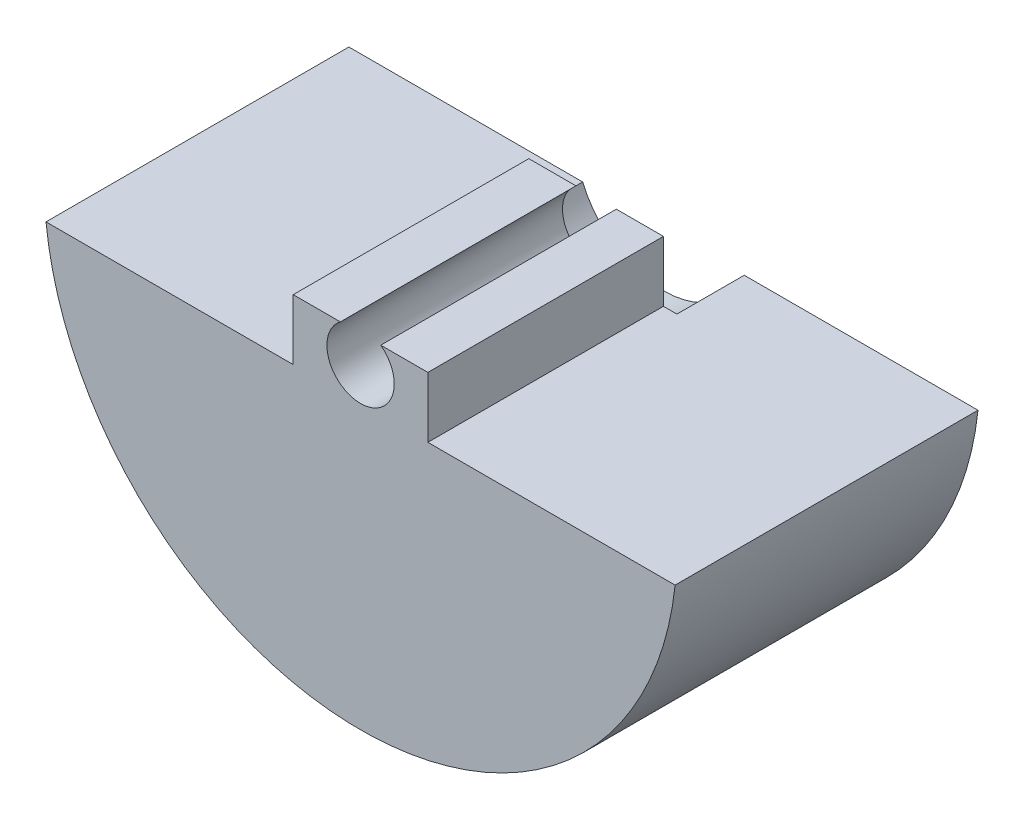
ISO-10303-21;
HEADER;
FILE_DESCRIPTION(('STEP AP214'),'2;1');
FILE_NAME('part.step','',(''),(''),'','','');
FILE_SCHEMA(('AUTOMOTIVE_DESIGN { 1 0 10303 214 1 1 1 1 }'));
ENDSEC;
DATA;
#1=APPLICATION_CONTEXT('core data for automotive mechanical design processes');
#2=APPLICATION_PROTOCOL_DEFINITION('international standard','automotive_design',2000,#1);
#3=PRODUCT_CONTEXT('',#1,'mechanical');
#4=PRODUCT('Part','Part','',(#3));
#5=PRODUCT_RELATED_PRODUCT_CATEGORY('part','',(#4));
#6=PRODUCT_DEFINITION_FORMATION('','',#4);
#7=PRODUCT_DEFINITION_CONTEXT('part definition',#1,'design');
#8=PRODUCT_DEFINITION('design','',#6,#7);
#9=PRODUCT_DEFINITION_SHAPE('','',#8);
#10=(LENGTH_UNIT() NAMED_UNIT(*) SI_UNIT(.MILLI.,.METRE.));
#11=(NAMED_UNIT(*) PLANE_ANGLE_UNIT() SI_UNIT($,.RADIAN.));
#12=(NAMED_UNIT(*) SI_UNIT($,.STERADIAN.) SOLID_ANGLE_UNIT());
#13=UNCERTAINTY_MEASURE_WITH_UNIT(LENGTH_MEASURE(1.E-05),#10,'distance_accuracy_value','');
#14=(GEOMETRIC_REPRESENTATION_CONTEXT(3) GLOBAL_UNCERTAINTY_ASSIGNED_CONTEXT((#13)) GLOBAL_UNIT_ASSIGNED_CONTEXT((#10,
#11,#12)) REPRESENTATION_CONTEXT('',''));
#15=CARTESIAN_POINT('',(0.,0.,0.));
#16=DIRECTION('',(0.,0.,1.));
#17=DIRECTION('',(1.,0.,0.));
#18=AXIS2_PLACEMENT_3D('',#15,#16,#17);
#19=CARTESIAN_POINT('',(-1.,-0.5,-4.5));
#20=DIRECTION('',(-1.,0.,0.));
#21=DIRECTION('',(0.,-1.,0.));
#22=AXIS2_PLACEMENT_3D('',#19,#20,#21);
#23=PLANE('',#22);
#24=DIRECTION('',(0.,0.,1.));
#25=VECTOR('',#24,1.);
#26=CARTESIAN_POINT('',(-1.,0.4,-4.5));
#27=LINE('',#26,#25);
#28=CARTESIAN_POINT('',(-1.,0.4,-3.5));
#29=VERTEX_POINT('',#28);
#30=CARTESIAN_POINT('',(-1.,0.4,0.));
#31=VERTEX_POINT('',#30);
#32=EDGE_CURVE('E171',#29,#31,#27,.T.);
#33=ORIENTED_EDGE('',*,*,#32,.F.);
#34=DIRECTION('',(0.,-1.,0.));
#35=VECTOR('',#34,1.);
#36=CARTESIAN_POINT('',(-1.,-0.5,-3.5));
#37=LINE('',#36,#35);
#38=CARTESIAN_POINT('',(-1.,-0.5,-3.5));
#39=VERTEX_POINT('',#38);
#40=EDGE_CURVE('E133',#29,#39,#37,.T.);
#41=ORIENTED_EDGE('',*,*,#40,.T.);
#42=DIRECTION('',(0.,0.,1.));
#43=VECTOR('',#42,1.);
#44=CARTESIAN_POINT('',(-1.,-0.5,-4.5));
#45=LINE('',#44,#43);
#46=CARTESIAN_POINT('',(-1.,-0.5,0.));
#47=VERTEX_POINT('',#46);
#48=EDGE_CURVE('E169',#39,#47,#45,.T.);
#49=ORIENTED_EDGE('',*,*,#48,.T.);
#50=DIRECTION('',(0.,-1.,0.));
#51=VECTOR('',#50,1.);
#52=CARTESIAN_POINT('',(-1.,-0.5,0.));
#53=LINE('',#52,#51);
#54=EDGE_CURVE('E156',#31,#47,#53,.T.);
#55=ORIENTED_EDGE('',*,*,#54,.F.);
#56=EDGE_LOOP('',(#33,#41,#49,#55));
#57=FACE_BOUND('',#56,.T.);
#58=ADVANCED_FACE('F26',(#57),#23,.T.);
#59=CARTESIAN_POINT('',(-1.,0.4,-4.5));
#60=DIRECTION('',(0.,1.,0.));
#61=DIRECTION('',(0.,0.,1.));
#62=AXIS2_PLACEMENT_3D('',#59,#60,#61);
#63=PLANE('',#62);
#64=DIRECTION('',(0.,0.,1.));
#65=VECTOR('',#64,1.);
#66=CARTESIAN_POINT('',(-0.300000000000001,0.4,-4.5));
#67=LINE('',#66,#65);
#68=CARTESIAN_POINT('',(-0.300000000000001,0.4,-3.5));
#69=VERTEX_POINT('',#68);
#70=CARTESIAN_POINT('',(-0.300000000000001,0.4,0.));
#71=VERTEX_POINT('',#70);
#72=EDGE_CURVE('E173',#69,#71,#67,.T.);
#73=ORIENTED_EDGE('',*,*,#72,.F.);
#74=DIRECTION('',(-1.,0.,0.));
#75=VECTOR('',#74,1.);
#76=CARTESIAN_POINT('',(-1.,0.4,-3.5));
#77=LINE('',#76,#75);
#78=EDGE_CURVE('E130',#69,#29,#77,.T.);
#79=ORIENTED_EDGE('',*,*,#78,.T.);
#80=ORIENTED_EDGE('',*,*,#32,.T.);
#81=DIRECTION('',(-1.,0.,0.));
#82=VECTOR('',#81,1.);
#83=CARTESIAN_POINT('',(-1.,0.4,0.));
#84=LINE('',#83,#82);
#85=EDGE_CURVE('E153',#71,#31,#84,.T.);
#86=ORIENTED_EDGE('',*,*,#85,.F.);
#87=EDGE_LOOP('',(#73,#79,#80,#86));
#88=FACE_BOUND('',#87,.T.);
#89=ADVANCED_FACE('F198',(#88),#63,.T.);
#90=CARTESIAN_POINT('',(0.,0.,-4.5));
#91=DIRECTION('',(0.,0.,1.));
#92=DIRECTION('',(1.,0.,0.));
#93=AXIS2_PLACEMENT_3D('',#90,#91,#92);
#94=CYLINDRICAL_SURFACE('',#93,0.5);
#95=DIRECTION('',(0.,0.,1.));
#96=VECTOR('',#95,1.);
#97=CARTESIAN_POINT('',(0.300000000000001,0.4,-4.5));
#98=LINE('',#97,#96);
#99=CARTESIAN_POINT('',(0.300000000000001,0.4,-3.5));
#100=VERTEX_POINT('',#99);
#101=CARTESIAN_POINT('',(0.300000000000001,0.4,0.));
#102=VERTEX_POINT('',#101);
#103=EDGE_CURVE('E175',#100,#102,#98,.T.);
#104=ORIENTED_EDGE('',*,*,#103,.F.);
#105=CARTESIAN_POINT('',(0.,0.,-3.5));
#106=DIRECTION('',(0.,0.,-1.));
#107=DIRECTION('',(-1.,0.,0.));
#108=AXIS2_PLACEMENT_3D('',#105,#106,#107);
#109=CIRCLE('',#108,0.5);
#110=EDGE_CURVE('E127',#100,#69,#109,.T.);
#111=ORIENTED_EDGE('',*,*,#110,.T.);
#112=ORIENTED_EDGE('',*,*,#72,.T.);
#113=CARTESIAN_POINT('',(0.,0.,0.));
#114=DIRECTION('',(0.,0.,-1.));
#115=DIRECTION('',(1.,0.,0.));
#116=AXIS2_PLACEMENT_3D('',#113,#114,#115);
#117=CIRCLE('',#116,0.5);
#118=EDGE_CURVE('E150',#102,#71,#117,.T.);
#119=ORIENTED_EDGE('',*,*,#118,.F.);
#120=EDGE_LOOP('',(#104,#111,#112,#119));
#121=FACE_BOUND('',#120,.T.);
#122=ADVANCED_FACE('F201',(#121),#94,.F.);
#123=CARTESIAN_POINT('',(0.300000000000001,0.4,-4.5));
#124=DIRECTION('',(0.,1.,0.));
#125=DIRECTION('',(0.,0.,1.));
#126=AXIS2_PLACEMENT_3D('',#123,#124,#125);
#127=PLANE('',#126);
#128=DIRECTION('',(0.,0.,1.));
#129=VECTOR('',#128,1.);
#130=CARTESIAN_POINT('',(1.,0.4,-4.5));
#131=LINE('',#130,#129);
#132=CARTESIAN_POINT('',(1.,0.4,-3.5));
#133=VERTEX_POINT('',#132);
#134=CARTESIAN_POINT('',(1.,0.4,0.));
#135=VERTEX_POINT('',#134);
#136=EDGE_CURVE('E177',#133,#135,#131,.T.);
#137=ORIENTED_EDGE('',*,*,#136,.F.);
#138=DIRECTION('',(-1.,0.,0.));
#139=VECTOR('',#138,1.);
#140=CARTESIAN_POINT('',(0.300000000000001,0.4,-3.5));
#141=LINE('',#140,#139);
#142=EDGE_CURVE('E124',#133,#100,#141,.T.);
#143=ORIENTED_EDGE('',*,*,#142,.T.);
#144=ORIENTED_EDGE('',*,*,#103,.T.);
#145=DIRECTION('',(-1.,0.,0.));
#146=VECTOR('',#145,1.);
#147=CARTESIAN_POINT('',(0.300000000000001,0.4,0.));
#148=LINE('',#147,#146);
#149=EDGE_CURVE('E147',#135,#102,#148,.T.);
#150=ORIENTED_EDGE('',*,*,#149,.F.);
#151=EDGE_LOOP('',(#137,#143,#144,#150));
#152=FACE_BOUND('',#151,.T.);
#153=ADVANCED_FACE('F206',(#152),#127,.T.);
#154=CARTESIAN_POINT('',(1.,0.4,-4.5));
#155=DIRECTION('',(1.,0.,0.));
#156=DIRECTION('',(0.,1.,0.));
#157=AXIS2_PLACEMENT_3D('',#154,#155,#156);
#158=PLANE('',#157);
#159=DIRECTION('',(0.,0.,1.));
#160=VECTOR('',#159,1.);
#161=CARTESIAN_POINT('',(1.,-0.5,-4.5));
#162=LINE('',#161,#160);
#163=CARTESIAN_POINT('',(1.,-0.5,-3.5));
#164=VERTEX_POINT('',#163);
#165=CARTESIAN_POINT('',(1.,-0.5,0.));
#166=VERTEX_POINT('',#165);
#167=EDGE_CURVE('E179',#164,#166,#162,.T.);
#168=ORIENTED_EDGE('',*,*,#167,.F.);
#169=DIRECTION('',(0.,1.,0.));
#170=VECTOR('',#169,1.);
#171=CARTESIAN_POINT('',(1.,0.4,-3.5));
#172=LINE('',#171,#170);
#173=EDGE_CURVE('E108',#164,#133,#172,.T.);
#174=ORIENTED_EDGE('',*,*,#173,.T.);
#175=ORIENTED_EDGE('',*,*,#136,.T.);
#176=DIRECTION('',(0.,1.,0.));
#177=VECTOR('',#176,1.);
#178=CARTESIAN_POINT('',(1.,0.4,0.));
#179=LINE('',#178,#177);
#180=EDGE_CURVE('E144',#166,#135,#179,.T.);
#181=ORIENTED_EDGE('',*,*,#180,.F.);
#182=EDGE_LOOP('',(#168,#174,#175,#181));
#183=FACE_BOUND('',#182,.T.);
#184=ADVANCED_FACE('F208',(#183),#158,.T.);
#185=CARTESIAN_POINT('',(0.,0.,-4.5));
#186=DIRECTION('',(0.,0.,1.));
#187=DIRECTION('',(1.,0.,0.));
#188=AXIS2_PLACEMENT_3D('',#185,#186,#187);
#189=CYLINDRICAL_SURFACE('',#188,4.7);
#190=CARTESIAN_POINT('',(0.,0.,0.));
#191=DIRECTION('',(0.,0.,1.));
#192=DIRECTION('',(1.,0.,0.));
#193=AXIS2_PLACEMENT_3D('',#190,#191,#192);
#194=CIRCLE('',#193,4.7);
#195=CARTESIAN_POINT('',(-4.67332857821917,-0.5,0.));
#196=VERTEX_POINT('',#195);
#197=CARTESIAN_POINT('',(4.67332857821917,-0.5,0.));
#198=VERTEX_POINT('',#197);
#199=EDGE_CURVE('E138',#196,#198,#194,.T.);
#200=ORIENTED_EDGE('',*,*,#199,.F.);
#201=DIRECTION('',(0.,0.,1.));
#202=VECTOR('',#201,1.);
#203=CARTESIAN_POINT('',(-4.67332857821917,-0.5,-4.5));
#204=LINE('',#203,#202);
#205=CARTESIAN_POINT('',(-4.67332857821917,-0.5,-4.5));
#206=VERTEX_POINT('',#205);
#207=EDGE_CURVE('E34',#206,#196,#204,.T.);
#208=ORIENTED_EDGE('',*,*,#207,.F.);
#209=CARTESIAN_POINT('',(0.,0.,-4.5));
#210=DIRECTION('',(0.,0.,1.));
#211=DIRECTION('',(1.,0.,0.));
#212=AXIS2_PLACEMENT_3D('',#209,#210,#211);
#213=CIRCLE('',#212,4.7);
#214=CARTESIAN_POINT('',(4.67332857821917,-0.5,-4.5));
#215=VERTEX_POINT('',#214);
#216=EDGE_CURVE('E162',#206,#215,#213,.T.);
#217=ORIENTED_EDGE('',*,*,#216,.T.);
#218=DIRECTION('',(0.,0.,1.));
#219=VECTOR('',#218,1.);
#220=CARTESIAN_POINT('',(4.67332857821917,-0.5,-4.5));
#221=LINE('',#220,#219);
#222=EDGE_CURVE('E167',#215,#198,#221,.T.);
#223=ORIENTED_EDGE('',*,*,#222,.T.);
#224=EDGE_LOOP('',(#200,#208,#217,#223));
#225=FACE_BOUND('',#224,.T.);
#226=ADVANCED_FACE('F28',(#225),#189,.T.);
#227=CARTESIAN_POINT('',(-4.67332857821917,-0.5,-4.5));
#228=DIRECTION('',(0.,1.,0.));
#229=DIRECTION('',(-1.,0.,0.));
#230=AXIS2_PLACEMENT_3D('',#227,#228,#229);
#231=PLANE('',#230);
#232=DIRECTION('',(0.,0.,-1.));
#233=VECTOR('',#232,1.);
#234=CARTESIAN_POINT('',(-1.2,-0.5,-3.5));
#235=LINE('',#234,#233);
#236=CARTESIAN_POINT('',(-1.2,-0.5,-4.5));
#237=VERTEX_POINT('',#236);
#238=CARTESIAN_POINT('',(-1.2,-0.5,-3.5));
#239=VERTEX_POINT('',#238);
#240=EDGE_CURVE('E112',#237,#239,#235,.F.);
#241=ORIENTED_EDGE('',*,*,#240,.F.);
#242=DIRECTION('',(-1.,0.,0.));
#243=VECTOR('',#242,1.);
#244=CARTESIAN_POINT('',(-4.67332857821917,-0.5,-4.5));
#245=LINE('',#244,#243);
#246=EDGE_CURVE('E49',#237,#206,#245,.T.);
#247=ORIENTED_EDGE('',*,*,#246,.T.);
#248=ORIENTED_EDGE('',*,*,#207,.T.);
#249=DIRECTION('',(-1.,0.,0.));
#250=VECTOR('',#249,1.);
#251=CARTESIAN_POINT('',(-4.67332857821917,-0.5,0.));
#252=LINE('',#251,#250);
#253=EDGE_CURVE('E159',#47,#196,#252,.T.);
#254=ORIENTED_EDGE('',*,*,#253,.F.);
#255=ORIENTED_EDGE('',*,*,#48,.F.);
#256=DIRECTION('',(-1.,0.,0.));
#257=VECTOR('',#256,1.);
#258=CARTESIAN_POINT('',(-4.67332857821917,-0.5,-3.5));
#259=LINE('',#258,#257);
#260=EDGE_CURVE('E136',#39,#239,#259,.T.);
#261=ORIENTED_EDGE('',*,*,#260,.T.);
#262=EDGE_LOOP('',(#241,#247,#248,#254,#255,#261));
#263=FACE_BOUND('',#262,.T.);
#264=ADVANCED_FACE('F190',(#263),#231,.T.);
#265=CARTESIAN_POINT('',(1.,-0.5,-4.5));
#266=DIRECTION('',(0.,1.,0.));
#267=DIRECTION('',(0.,0.,1.));
#268=AXIS2_PLACEMENT_3D('',#265,#266,#267);
#269=PLANE('',#268);
#270=DIRECTION('',(0.,0.,-1.));
#271=VECTOR('',#270,1.);
#272=CARTESIAN_POINT('',(1.2,-0.5,-3.5));
#273=LINE('',#272,#271);
#274=CARTESIAN_POINT('',(1.2,-0.5,-3.5));
#275=VERTEX_POINT('',#274);
#276=CARTESIAN_POINT('',(1.2,-0.5,-4.5));
#277=VERTEX_POINT('',#276);
#278=EDGE_CURVE('E41',#275,#277,#273,.T.);
#279=ORIENTED_EDGE('',*,*,#278,.F.);
#280=DIRECTION('',(-1.,0.,0.));
#281=VECTOR('',#280,1.);
#282=CARTESIAN_POINT('',(1.,-0.5,-3.5));
#283=LINE('',#282,#281);
#284=EDGE_CURVE('E11',#275,#164,#283,.T.);
#285=ORIENTED_EDGE('',*,*,#284,.T.);
#286=ORIENTED_EDGE('',*,*,#167,.T.);
#287=DIRECTION('',(-1.,0.,0.));
#288=VECTOR('',#287,1.);
#289=CARTESIAN_POINT('',(1.,-0.5,0.));
#290=LINE('',#289,#288);
#291=EDGE_CURVE('E141',#198,#166,#290,.T.);
#292=ORIENTED_EDGE('',*,*,#291,.F.);
#293=ORIENTED_EDGE('',*,*,#222,.F.);
#294=DIRECTION('',(-1.,0.,0.));
#295=VECTOR('',#294,1.);
#296=CARTESIAN_POINT('',(1.,-0.5,-4.5));
#297=LINE('',#296,#295);
#298=EDGE_CURVE('E118',#215,#277,#297,.T.);
#299=ORIENTED_EDGE('',*,*,#298,.T.);
#300=EDGE_LOOP('',(#279,#285,#286,#292,#293,#299));
#301=FACE_BOUND('',#300,.T.);
#302=ADVANCED_FACE('F116',(#301),#269,.T.);
#303=CARTESIAN_POINT('',(0.,0.,-4.5));
#304=DIRECTION('',(0.,0.,1.));
#305=DIRECTION('',(1.,0.,0.));
#306=AXIS2_PLACEMENT_3D('',#303,#304,#305);
#307=PLANE('',#306);
#308=ORIENTED_EDGE('',*,*,#246,.F.);
#309=CARTESIAN_POINT('',(0.,0.,-4.5));
#310=DIRECTION('',(0.,0.,-1.));
#311=DIRECTION('',(-1.,0.,0.));
#312=AXIS2_PLACEMENT_3D('',#309,#310,#311);
#313=CIRCLE('',#312,1.3);
#314=EDGE_CURVE('E113',#277,#237,#313,.T.);
#315=ORIENTED_EDGE('',*,*,#314,.F.);
#316=ORIENTED_EDGE('',*,*,#298,.F.);
#317=ORIENTED_EDGE('',*,*,#216,.F.);
#318=EDGE_LOOP('',(#308,#315,#316,#317));
#319=FACE_BOUND('',#318,.T.);
#320=ADVANCED_FACE('F192',(#319),#307,.F.);
#321=CARTESIAN_POINT('',(0.,0.,0.));
#322=DIRECTION('',(0.,0.,1.));
#323=DIRECTION('',(1.,0.,0.));
#324=AXIS2_PLACEMENT_3D('',#321,#322,#323);
#325=PLANE('',#324);
#326=ORIENTED_EDGE('',*,*,#199,.T.);
#327=ORIENTED_EDGE('',*,*,#291,.T.);
#328=ORIENTED_EDGE('',*,*,#180,.T.);
#329=ORIENTED_EDGE('',*,*,#149,.T.);
#330=ORIENTED_EDGE('',*,*,#118,.T.);
#331=ORIENTED_EDGE('',*,*,#85,.T.);
#332=ORIENTED_EDGE('',*,*,#54,.T.);
#333=ORIENTED_EDGE('',*,*,#253,.T.);
#334=EDGE_LOOP('',(#326,#327,#328,#329,#330,#331,#332,#333));
#335=FACE_BOUND('',#334,.T.);
#336=ADVANCED_FACE('F186',(#335),#325,.T.);
#337=CARTESIAN_POINT('',(0.,0.,-3.5));
#338=DIRECTION('',(0.,0.,-1.));
#339=DIRECTION('',(-1.,0.,0.));
#340=AXIS2_PLACEMENT_3D('',#337,#338,#339);
#341=CYLINDRICAL_SURFACE('',#340,1.3);
#342=ORIENTED_EDGE('',*,*,#240,.T.);
#343=CARTESIAN_POINT('',(0.,0.,-3.5));
#344=DIRECTION('',(0.,0.,-1.));
#345=DIRECTION('',(-1.,0.,0.));
#346=AXIS2_PLACEMENT_3D('',#343,#344,#345);
#347=CIRCLE('',#346,1.3);
#348=EDGE_CURVE('E105',#275,#239,#347,.T.);
#349=ORIENTED_EDGE('',*,*,#348,.F.);
#350=ORIENTED_EDGE('',*,*,#278,.T.);
#351=ORIENTED_EDGE('',*,*,#314,.T.);
#352=EDGE_LOOP('',(#342,#349,#350,#351));
#353=FACE_BOUND('',#352,.T.);
#354=ADVANCED_FACE('F111',(#353),#341,.F.);
#355=CARTESIAN_POINT('',(0.,0.,-3.5));
#356=DIRECTION('',(0.,0.,-1.));
#357=DIRECTION('',(-1.,0.,0.));
#358=AXIS2_PLACEMENT_3D('',#355,#356,#357);
#359=PLANE('',#358);
#360=ORIENTED_EDGE('',*,*,#40,.F.);
#361=ORIENTED_EDGE('',*,*,#78,.F.);
#362=ORIENTED_EDGE('',*,*,#110,.F.);
#363=ORIENTED_EDGE('',*,*,#142,.F.);
#364=ORIENTED_EDGE('',*,*,#173,.F.);
#365=ORIENTED_EDGE('',*,*,#284,.F.);
#366=ORIENTED_EDGE('',*,*,#348,.T.);
#367=ORIENTED_EDGE('',*,*,#260,.F.);
#368=EDGE_LOOP('',(#360,#361,#362,#363,#364,#365,#366,#367));
#369=FACE_BOUND('',#368,.T.);
#370=ADVANCED_FACE('F104',(#369),#359,.T.);
#371=CLOSED_SHELL('',(#58,#89,#122,#153,#184,#226,#264,#302,#320,#336,#354,#370));
#372=MANIFOLD_SOLID_BREP('B2',#371);
#373=ADVANCED_BREP_SHAPE_REPRESENTATION('',(#18,#372),#14);
#374=SHAPE_DEFINITION_REPRESENTATION(#9,#373);
ENDSEC;
END-ISO-10303-21;
